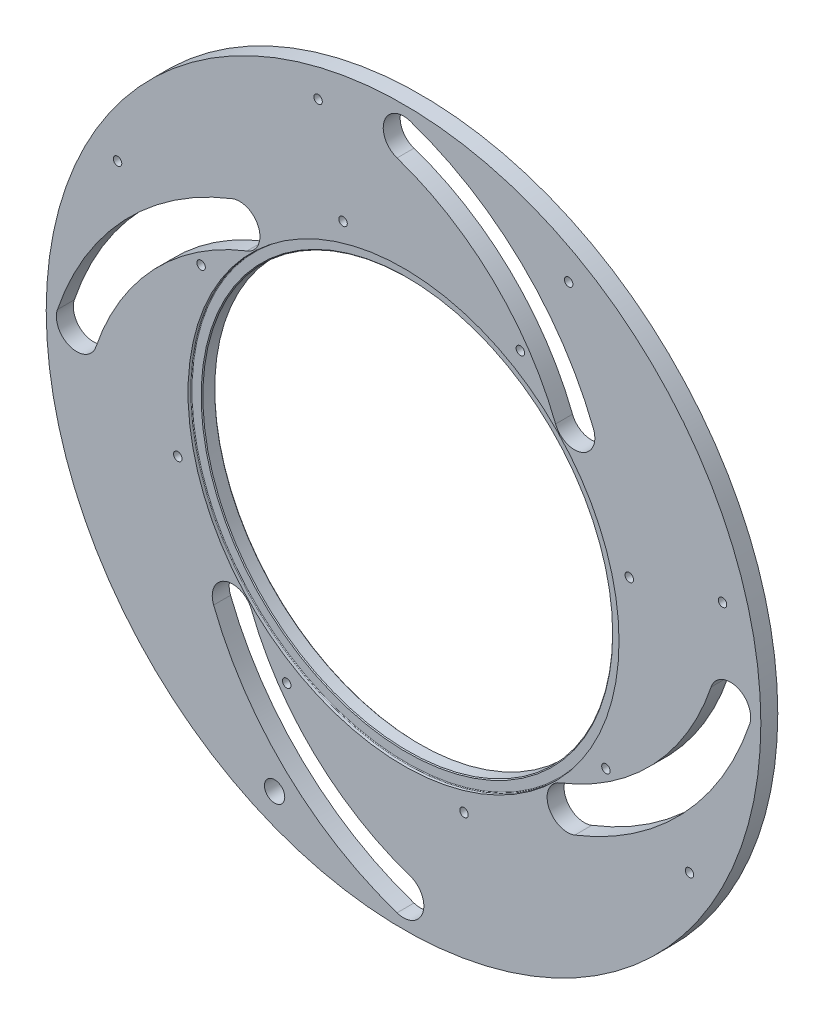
ISO-10303-21;
HEADER;
FILE_DESCRIPTION(('STEP AP214'),'2;1');
FILE_NAME('part.step','',(''),(''),'','','');
FILE_SCHEMA(('AUTOMOTIVE_DESIGN { 1 0 10303 214 1 1 1 1 }'));
ENDSEC;
DATA;
#1=APPLICATION_CONTEXT('core data for automotive mechanical design processes');
#2=APPLICATION_PROTOCOL_DEFINITION('international standard','automotive_design',2000,#1);
#3=PRODUCT_CONTEXT('',#1,'mechanical');
#4=PRODUCT('Part','Part','',(#3));
#5=PRODUCT_RELATED_PRODUCT_CATEGORY('part','',(#4));
#6=PRODUCT_DEFINITION_FORMATION('','',#4);
#7=PRODUCT_DEFINITION_CONTEXT('part definition',#1,'design');
#8=PRODUCT_DEFINITION('design','',#6,#7);
#9=PRODUCT_DEFINITION_SHAPE('','',#8);
#10=(LENGTH_UNIT() NAMED_UNIT(*) SI_UNIT(.MILLI.,.METRE.));
#11=(NAMED_UNIT(*) PLANE_ANGLE_UNIT() SI_UNIT($,.RADIAN.));
#12=(NAMED_UNIT(*) SI_UNIT($,.STERADIAN.) SOLID_ANGLE_UNIT());
#13=UNCERTAINTY_MEASURE_WITH_UNIT(LENGTH_MEASURE(1.E-05),#10,'distance_accuracy_value','');
#14=(GEOMETRIC_REPRESENTATION_CONTEXT(3) GLOBAL_UNCERTAINTY_ASSIGNED_CONTEXT((#13)) GLOBAL_UNIT_ASSIGNED_CONTEXT((#10,
#11,#12)) REPRESENTATION_CONTEXT('',''));
#15=CARTESIAN_POINT('',(0.,0.,0.));
#16=DIRECTION('',(0.,0.,1.));
#17=DIRECTION('',(1.,0.,0.));
#18=AXIS2_PLACEMENT_3D('',#15,#16,#17);
#19=CARTESIAN_POINT('',(0.,0.,10.));
#20=DIRECTION('',(0.,0.,1.));
#21=DIRECTION('',(1.,0.,0.));
#22=AXIS2_PLACEMENT_3D('',#19,#20,#21);
#23=PLANE('',#22);
#24=CARTESIAN_POINT('',(-168.874953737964,97.500000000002,10.));
#25=DIRECTION('',(0.,0.,-1.));
#26=DIRECTION('',(-1.,0.,0.));
#27=AXIS2_PLACEMENT_3D('',#24,#25,#26);
#28=CIRCLE('',#27,2.5);
#29=CARTESIAN_POINT('',(-171.374953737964,97.500000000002,10.));
#30=VERTEX_POINT('',#29);
#31=EDGE_CURVE('E519',#30,#30,#28,.T.);
#32=ORIENTED_EDGE('',*,*,#31,.T.);
#33=EDGE_LOOP('',(#32));
#34=FACE_BOUND('',#33,.T.);
#35=CARTESIAN_POINT('',(188.355536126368,50.4697137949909,10.));
#36=DIRECTION('',(0.,0.,-1.));
#37=DIRECTION('',(-1.,0.,0.));
#38=AXIS2_PLACEMENT_3D('',#35,#36,#37);
#39=CIRCLE('',#38,2.5);
#40=CARTESIAN_POINT('',(185.855536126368,50.4697137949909,10.));
#41=VERTEX_POINT('',#40);
#42=EDGE_CURVE('E503',#41,#41,#39,.T.);
#43=ORIENTED_EDGE('',*,*,#42,.T.);
#44=EDGE_LOOP('',(#43));
#45=FACE_BOUND('',#44,.T.);
#46=CARTESIAN_POINT('',(97.5000000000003,168.874953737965,10.));
#47=DIRECTION('',(0.,0.,-1.));
#48=DIRECTION('',(-1.,0.,0.));
#49=AXIS2_PLACEMENT_3D('',#46,#47,#48);
#50=CIRCLE('',#49,2.5);
#51=CARTESIAN_POINT('',(95.0000000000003,168.874953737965,10.));
#52=VERTEX_POINT('',#51);
#53=EDGE_CURVE('E495',#52,#52,#50,.T.);
#54=ORIENTED_EDGE('',*,*,#53,.T.);
#55=EDGE_LOOP('',(#54));
#56=FACE_BOUND('',#55,.T.);
#57=CARTESIAN_POINT('',(-119.511505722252,69.0000000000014,10.));
#58=DIRECTION('',(0.,0.,-1.));
#59=DIRECTION('',(-1.,0.,0.));
#60=AXIS2_PLACEMENT_3D('',#57,#58,#59);
#61=CIRCLE('',#60,2.5);
#62=CARTESIAN_POINT('',(-122.011505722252,69.0000000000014,10.));
#63=VERTEX_POINT('',#62);
#64=EDGE_CURVE('E479',#63,#63,#61,.T.);
#65=ORIENTED_EDGE('',*,*,#64,.T.);
#66=EDGE_LOOP('',(#65));
#67=FACE_BOUND('',#66,.T.);
#68=CARTESIAN_POINT('',(-69.000000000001,-119.511505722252,10.));
#69=DIRECTION('',(0.,0.,-1.));
#70=DIRECTION('',(-1.,0.,0.));
#71=AXIS2_PLACEMENT_3D('',#68,#69,#70);
#72=CIRCLE('',#71,2.5);
#73=CARTESIAN_POINT('',(-71.500000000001,-119.511505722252,10.));
#74=VERTEX_POINT('',#73);
#75=EDGE_CURVE('E463',#74,#74,#72,.T.);
#76=ORIENTED_EDGE('',*,*,#75,.T.);
#77=EDGE_LOOP('',(#76));
#78=FACE_BOUND('',#77,.T.);
#79=CARTESIAN_POINT('',(119.511505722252,-69.0000000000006,10.));
#80=DIRECTION('',(0.,0.,-1.));
#81=DIRECTION('',(-1.,0.,0.));
#82=AXIS2_PLACEMENT_3D('',#79,#80,#81);
#83=CIRCLE('',#82,2.5);
#84=CARTESIAN_POINT('',(117.011505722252,-69.0000000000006,10.));
#85=VERTEX_POINT('',#84);
#86=EDGE_CURVE('E447',#85,#85,#83,.T.);
#87=ORIENTED_EDGE('',*,*,#86,.T.);
#88=EDGE_LOOP('',(#87));
#89=FACE_BOUND('',#88,.T.);
#90=CARTESIAN_POINT('',(133.297764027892,35.7170282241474,10.));
#91=DIRECTION('',(0.,0.,-1.));
#92=DIRECTION('',(-1.,0.,0.));
#93=AXIS2_PLACEMENT_3D('',#90,#91,#92);
#94=CIRCLE('',#93,2.5);
#95=CARTESIAN_POINT('',(130.797764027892,35.7170282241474,10.));
#96=VERTEX_POINT('',#95);
#97=EDGE_CURVE('E439',#96,#96,#94,.T.);
#98=ORIENTED_EDGE('',*,*,#97,.T.);
#99=EDGE_LOOP('',(#98));
#100=FACE_BOUND('',#99,.T.);
#101=CARTESIAN_POINT('',(69.0000000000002,119.511505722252,10.));
#102=DIRECTION('',(0.,0.,-1.));
#103=DIRECTION('',(-1.,0.,0.));
#104=AXIS2_PLACEMENT_3D('',#101,#102,#103);
#105=CIRCLE('',#104,2.5);
#106=CARTESIAN_POINT('',(66.5000000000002,119.511505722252,10.));
#107=VERTEX_POINT('',#106);
#108=EDGE_CURVE('E431',#107,#107,#105,.T.);
#109=ORIENTED_EDGE('',*,*,#108,.T.);
#110=EDGE_LOOP('',(#109));
#111=FACE_BOUND('',#110,.T.);
#112=CARTESIAN_POINT('',(0.,0.,10.));
#113=DIRECTION('',(0.,0.,1.));
#114=DIRECTION('',(1.,0.,0.));
#115=AXIS2_PLACEMENT_3D('',#112,#113,#114);
#116=CIRCLE('',#115,127.25);
#117=CARTESIAN_POINT('',(127.25,0.,10.));
#118=VERTEX_POINT('',#117);
#119=EDGE_CURVE('E426',#118,#118,#116,.T.);
#120=ORIENTED_EDGE('',*,*,#119,.F.);
#121=EDGE_LOOP('',(#120));
#122=FACE_BOUND('',#121,.T.);
#123=CARTESIAN_POINT('',(-76.1279568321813,-178.439161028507,10.));
#124=DIRECTION('',(0.,0.,1.));
#125=DIRECTION('',(1.,0.,0.));
#126=AXIS2_PLACEMENT_3D('',#123,#124,#125);
#127=CIRCLE('',#126,6.);
#128=CARTESIAN_POINT('',(-70.1279568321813,-178.439161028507,10.));
#129=VERTEX_POINT('',#128);
#130=EDGE_CURVE('E187',#129,#129,#127,.T.);
#131=ORIENTED_EDGE('',*,*,#130,.F.);
#132=EDGE_LOOP('',(#131));
#133=FACE_BOUND('',#132,.T.);
#134=CARTESIAN_POINT('',(-36.6356255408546,-52.6799999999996,10.));
#135=DIRECTION('',(0.,0.,-1.));
#136=DIRECTION('',(0.,1.,0.));
#137=AXIS2_PLACEMENT_3D('',#134,#135,#136);
#138=CIRCLE('',#137,153.);
#139=CARTESIAN_POINT('',(-181.62804549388,-3.83127272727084,10.));
#140=VERTEX_POINT('',#139);
#141=CARTESIAN_POINT('',(-92.4146605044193,89.7899942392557,10.));
#142=VERTEX_POINT('',#141);
#143=EDGE_CURVE('E61',#140,#142,#138,.T.);
#144=ORIENTED_EDGE('',*,*,#143,.F.);
#145=CARTESIAN_POINT('',(-193.,2.02156769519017E-12,10.));
#146=DIRECTION('',(0.,0.,1.));
#147=DIRECTION('',(0.,1.,0.));
#148=AXIS2_PLACEMENT_3D('',#145,#146,#147);
#149=CIRCLE('',#148,12.);
#150=CARTESIAN_POINT('',(-204.37195450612,3.83127272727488,10.));
#151=VERTEX_POINT('',#150);
#152=EDGE_CURVE('E180',#151,#140,#149,.T.);
#153=ORIENTED_EDGE('',*,*,#152,.F.);
#154=CARTESIAN_POINT('',(-36.6356255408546,-52.6799999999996,10.));
#155=DIRECTION('',(0.,0.,1.));
#156=DIRECTION('',(0.,1.,0.));
#157=AXIS2_PLACEMENT_3D('',#154,#155,#156);
#158=CIRCLE('',#157,177.);
#159=CARTESIAN_POINT('',(-101.164313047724,112.138228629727,10.));
#160=VERTEX_POINT('',#159);
#161=EDGE_CURVE('E184',#160,#151,#158,.T.);
#162=ORIENTED_EDGE('',*,*,#161,.F.);
#163=CARTESIAN_POINT('',(-96.7894867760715,100.964111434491,10.));
#164=DIRECTION('',(0.,0.,1.));
#165=DIRECTION('',(0.,1.,0.));
#166=AXIS2_PLACEMENT_3D('',#163,#164,#165);
#167=CIRCLE('',#166,12.);
#168=EDGE_CURVE('E196',#142,#160,#167,.T.);
#169=ORIENTED_EDGE('',*,*,#168,.F.);
#170=EDGE_LOOP('',(#144,#153,#162,#169));
#171=FACE_BOUND('',#170,.T.);
#172=CARTESIAN_POINT('',(52.6799999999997,-36.6356255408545,10.));
#173=DIRECTION('',(0.,0.,-1.));
#174=DIRECTION('',(-1.,0.,0.));
#175=AXIS2_PLACEMENT_3D('',#172,#173,#174);
#176=CIRCLE('',#175,153.);
#177=CARTESIAN_POINT('',(3.83127272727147,-181.62804549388,10.));
#178=VERTEX_POINT('',#177);
#179=CARTESIAN_POINT('',(-89.7899942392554,-92.4146605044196,10.));
#180=VERTEX_POINT('',#179);
#181=EDGE_CURVE('E206',#178,#180,#176,.T.);
#182=ORIENTED_EDGE('',*,*,#181,.F.);
#183=CARTESIAN_POINT('',(-1.34771179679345E-12,-193.,10.));
#184=DIRECTION('',(0.,0.,1.));
#185=DIRECTION('',(-1.,0.,0.));
#186=AXIS2_PLACEMENT_3D('',#183,#184,#185);
#187=CIRCLE('',#186,12.);
#188=CARTESIAN_POINT('',(-3.83127272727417,-204.37195450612,10.));
#189=VERTEX_POINT('',#188);
#190=EDGE_CURVE('E217',#189,#178,#187,.T.);
#191=ORIENTED_EDGE('',*,*,#190,.F.);
#192=CARTESIAN_POINT('',(52.6799999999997,-36.6356255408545,10.));
#193=DIRECTION('',(0.,0.,1.));
#194=DIRECTION('',(-1.,0.,0.));
#195=AXIS2_PLACEMENT_3D('',#192,#193,#194);
#196=CIRCLE('',#195,177.);
#197=CARTESIAN_POINT('',(-112.138228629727,-101.164313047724,10.));
#198=VERTEX_POINT('',#197);
#199=EDGE_CURVE('E236',#198,#189,#196,.T.);
#200=ORIENTED_EDGE('',*,*,#199,.F.);
#201=CARTESIAN_POINT('',(-100.964111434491,-96.7894867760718,10.));
#202=DIRECTION('',(0.,0.,1.));
#203=DIRECTION('',(-1.,0.,0.));
#204=AXIS2_PLACEMENT_3D('',#201,#202,#203);
#205=CIRCLE('',#204,12.);
#206=EDGE_CURVE('E232',#180,#198,#205,.T.);
#207=ORIENTED_EDGE('',*,*,#206,.F.);
#208=EDGE_LOOP('',(#182,#191,#200,#207));
#209=FACE_BOUND('',#208,.T.);
#210=CARTESIAN_POINT('',(36.6356255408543,52.6799999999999,10.));
#211=DIRECTION('',(0.,0.,-1.));
#212=DIRECTION('',(0.,-1.,0.));
#213=AXIS2_PLACEMENT_3D('',#210,#211,#212);
#214=CIRCLE('',#213,153.);
#215=CARTESIAN_POINT('',(181.62804549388,3.83127272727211,10.));
#216=VERTEX_POINT('',#215);
#217=CARTESIAN_POINT('',(92.4146605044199,-89.789994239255,10.));
#218=VERTEX_POINT('',#217);
#219=EDGE_CURVE('E246',#216,#218,#214,.T.);
#220=ORIENTED_EDGE('',*,*,#219,.F.);
#221=CARTESIAN_POINT('',(193.,-6.73855898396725E-13,10.));
#222=DIRECTION('',(0.,0.,1.));
#223=DIRECTION('',(0.,-1.,0.));
#224=AXIS2_PLACEMENT_3D('',#221,#222,#223);
#225=CIRCLE('',#224,12.);
#226=CARTESIAN_POINT('',(204.37195450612,-3.83127272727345,10.));
#227=VERTEX_POINT('',#226);
#228=EDGE_CURVE('E261',#227,#216,#225,.T.);
#229=ORIENTED_EDGE('',*,*,#228,.F.);
#230=CARTESIAN_POINT('',(36.6356255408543,52.6799999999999,10.));
#231=DIRECTION('',(0.,0.,1.));
#232=DIRECTION('',(0.,-1.,0.));
#233=AXIS2_PLACEMENT_3D('',#230,#231,#232);
#234=CIRCLE('',#233,177.);
#235=CARTESIAN_POINT('',(101.164313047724,-112.138228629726,10.));
#236=VERTEX_POINT('',#235);
#237=EDGE_CURVE('E280',#236,#227,#234,.T.);
#238=ORIENTED_EDGE('',*,*,#237,.F.);
#239=CARTESIAN_POINT('',(96.7894867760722,-100.964111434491,10.));
#240=DIRECTION('',(0.,0.,1.));
#241=DIRECTION('',(0.,-1.,0.));
#242=AXIS2_PLACEMENT_3D('',#239,#240,#241);
#243=CIRCLE('',#242,12.);
#244=EDGE_CURVE('E276',#218,#236,#243,.T.);
#245=ORIENTED_EDGE('',*,*,#244,.F.);
#246=EDGE_LOOP('',(#220,#229,#238,#245));
#247=FACE_BOUND('',#246,.T.);
#248=CARTESIAN_POINT('',(-52.68,36.6356255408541,10.));
#249=DIRECTION('',(0.,0.,-1.));
#250=DIRECTION('',(1.,0.,0.));
#251=AXIS2_PLACEMENT_3D('',#248,#249,#250);
#252=CIRCLE('',#251,153.);
#253=CARTESIAN_POINT('',(-3.83127272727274,181.62804549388,10.));
#254=VERTEX_POINT('',#253);
#255=CARTESIAN_POINT('',(89.7899942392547,92.4146605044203,10.));
#256=VERTEX_POINT('',#255);
#257=EDGE_CURVE('E290',#254,#256,#252,.T.);
#258=ORIENTED_EDGE('',*,*,#257,.F.);
#259=CARTESIAN_POINT('',(0.,193.,10.));
#260=DIRECTION('',(0.,0.,1.));
#261=DIRECTION('',(1.,0.,0.));
#262=AXIS2_PLACEMENT_3D('',#259,#260,#261);
#263=CIRCLE('',#262,12.);
#264=CARTESIAN_POINT('',(3.83127272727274,204.37195450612,10.));
#265=VERTEX_POINT('',#264);
#266=EDGE_CURVE('E305',#265,#254,#263,.T.);
#267=ORIENTED_EDGE('',*,*,#266,.F.);
#268=CARTESIAN_POINT('',(-52.68,36.6356255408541,10.));
#269=DIRECTION('',(0.,0.,1.));
#270=DIRECTION('',(1.,0.,0.));
#271=AXIS2_PLACEMENT_3D('',#268,#269,#270);
#272=CIRCLE('',#271,177.);
#273=CARTESIAN_POINT('',(112.138228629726,101.164313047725,10.));
#274=VERTEX_POINT('',#273);
#275=EDGE_CURVE('E324',#274,#265,#272,.T.);
#276=ORIENTED_EDGE('',*,*,#275,.F.);
#277=CARTESIAN_POINT('',(100.96411143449,96.7894867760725,10.));
#278=DIRECTION('',(0.,0.,1.));
#279=DIRECTION('',(1.,0.,0.));
#280=AXIS2_PLACEMENT_3D('',#277,#278,#279);
#281=CIRCLE('',#280,12.);
#282=EDGE_CURVE('E320',#256,#274,#281,.T.);
#283=ORIENTED_EDGE('',*,*,#282,.F.);
#284=EDGE_LOOP('',(#258,#267,#276,#283));
#285=FACE_BOUND('',#284,.T.);
#286=CARTESIAN_POINT('',(0.,0.,10.));
#287=DIRECTION('',(0.,0.,1.));
#288=DIRECTION('',(1.,0.,0.));
#289=AXIS2_PLACEMENT_3D('',#286,#287,#288);
#290=CIRCLE('',#289,211.);
#291=CARTESIAN_POINT('',(211.,0.,10.));
#292=VERTEX_POINT('',#291);
#293=EDGE_CURVE('E344',#292,#292,#290,.T.);
#294=ORIENTED_EDGE('',*,*,#293,.T.);
#295=EDGE_LOOP('',(#294));
#296=FACE_BOUND('',#295,.T.);
#297=CARTESIAN_POINT('',(35.717028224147,-133.297764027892,10.));
#298=DIRECTION('',(0.,0.,-1.));
#299=DIRECTION('',(-1.,0.,0.));
#300=AXIS2_PLACEMENT_3D('',#297,#298,#299);
#301=CIRCLE('',#300,2.5);
#302=CARTESIAN_POINT('',(33.217028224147,-133.297764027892,10.));
#303=VERTEX_POINT('',#302);
#304=EDGE_CURVE('E455',#303,#303,#301,.T.);
#305=ORIENTED_EDGE('',*,*,#304,.T.);
#306=EDGE_LOOP('',(#305));
#307=FACE_BOUND('',#306,.T.);
#308=CARTESIAN_POINT('',(-133.297764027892,-35.7170282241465,10.));
#309=DIRECTION('',(0.,0.,-1.));
#310=DIRECTION('',(-1.,0.,0.));
#311=AXIS2_PLACEMENT_3D('',#308,#309,#310);
#312=CIRCLE('',#311,2.5);
#313=CARTESIAN_POINT('',(-135.797764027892,-35.7170282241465,10.));
#314=VERTEX_POINT('',#313);
#315=EDGE_CURVE('E471',#314,#314,#312,.T.);
#316=ORIENTED_EDGE('',*,*,#315,.T.);
#317=EDGE_LOOP('',(#316));
#318=FACE_BOUND('',#317,.T.);
#319=CARTESIAN_POINT('',(-35.7170282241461,133.297764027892,10.));
#320=DIRECTION('',(0.,0.,-1.));
#321=DIRECTION('',(-1.,0.,0.));
#322=AXIS2_PLACEMENT_3D('',#319,#320,#321);
#323=CIRCLE('',#322,2.5);
#324=CARTESIAN_POINT('',(-38.217028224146,133.297764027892,10.));
#325=VERTEX_POINT('',#324);
#326=EDGE_CURVE('E487',#325,#325,#323,.T.);
#327=ORIENTED_EDGE('',*,*,#326,.T.);
#328=EDGE_LOOP('',(#327));
#329=FACE_BOUND('',#328,.T.);
#330=CARTESIAN_POINT('',(168.874953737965,-97.5000000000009,10.));
#331=DIRECTION('',(0.,0.,-1.));
#332=DIRECTION('',(-1.,0.,0.));
#333=AXIS2_PLACEMENT_3D('',#330,#331,#332);
#334=CIRCLE('',#333,2.5);
#335=CARTESIAN_POINT('',(166.374953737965,-97.5000000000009,10.));
#336=VERTEX_POINT('',#335);
#337=EDGE_CURVE('E511',#336,#336,#334,.T.);
#338=ORIENTED_EDGE('',*,*,#337,.T.);
#339=EDGE_LOOP('',(#338));
#340=FACE_BOUND('',#339,.T.);
#341=CARTESIAN_POINT('',(-50.4697137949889,188.355536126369,10.));
#342=DIRECTION('',(0.,0.,-1.));
#343=DIRECTION('',(-1.,0.,0.));
#344=AXIS2_PLACEMENT_3D('',#341,#342,#343);
#345=CIRCLE('',#344,2.5);
#346=CARTESIAN_POINT('',(-52.9697137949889,188.355536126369,10.));
#347=VERTEX_POINT('',#346);
#348=EDGE_CURVE('E526',#347,#347,#345,.T.);
#349=ORIENTED_EDGE('',*,*,#348,.T.);
#350=EDGE_LOOP('',(#349));
#351=FACE_BOUND('',#350,.T.);
#352=ADVANCED_FACE('F45',(#34,#45,#56,#67,#78,#89,#100,#111,#122,#133,#171,#209,#247,#285,#296,
#307,#318,#329,#340,#351),#23,.T.);
#353=CARTESIAN_POINT('',(0.,0.,0.));
#354=DIRECTION('',(0.,0.,1.));
#355=DIRECTION('',(1.,0.,0.));
#356=AXIS2_PLACEMENT_3D('',#353,#354,#355);
#357=PLANE('',#356);
#358=CARTESIAN_POINT('',(-50.4697137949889,188.355536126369,0.));
#359=DIRECTION('',(0.,0.,-1.));
#360=DIRECTION('',(-1.,0.,0.));
#361=AXIS2_PLACEMENT_3D('',#358,#359,#360);
#362=CIRCLE('',#361,2.49999999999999);
#363=CARTESIAN_POINT('',(-52.9697137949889,188.355536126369,0.));
#364=VERTEX_POINT('',#363);
#365=EDGE_CURVE('E530',#364,#364,#362,.T.);
#366=ORIENTED_EDGE('',*,*,#365,.F.);
#367=EDGE_LOOP('',(#366));
#368=FACE_BOUND('',#367,.T.);
#369=CARTESIAN_POINT('',(168.874953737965,-97.5000000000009,0.));
#370=DIRECTION('',(0.,0.,-1.));
#371=DIRECTION('',(-1.,0.,0.));
#372=AXIS2_PLACEMENT_3D('',#369,#370,#371);
#373=CIRCLE('',#372,2.49999999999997);
#374=CARTESIAN_POINT('',(166.374953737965,-97.5000000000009,0.));
#375=VERTEX_POINT('',#374);
#376=EDGE_CURVE('E515',#375,#375,#373,.T.);
#377=ORIENTED_EDGE('',*,*,#376,.F.);
#378=EDGE_LOOP('',(#377));
#379=FACE_BOUND('',#378,.T.);
#380=CARTESIAN_POINT('',(97.5000000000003,168.874953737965,0.));
#381=DIRECTION('',(0.,0.,-1.));
#382=DIRECTION('',(-1.,0.,0.));
#383=AXIS2_PLACEMENT_3D('',#380,#381,#382);
#384=CIRCLE('',#383,2.49999999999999);
#385=CARTESIAN_POINT('',(95.0000000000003,168.874953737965,0.));
#386=VERTEX_POINT('',#385);
#387=EDGE_CURVE('E499',#386,#386,#384,.T.);
#388=ORIENTED_EDGE('',*,*,#387,.F.);
#389=EDGE_LOOP('',(#388));
#390=FACE_BOUND('',#389,.T.);
#391=CARTESIAN_POINT('',(-69.000000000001,-119.511505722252,0.));
#392=DIRECTION('',(0.,0.,-1.));
#393=DIRECTION('',(-1.,0.,0.));
#394=AXIS2_PLACEMENT_3D('',#391,#392,#393);
#395=CIRCLE('',#394,2.5);
#396=CARTESIAN_POINT('',(-71.500000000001,-119.511505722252,0.));
#397=VERTEX_POINT('',#396);
#398=EDGE_CURVE('E467',#397,#397,#395,.T.);
#399=ORIENTED_EDGE('',*,*,#398,.F.);
#400=EDGE_LOOP('',(#399));
#401=FACE_BOUND('',#400,.T.);
#402=CARTESIAN_POINT('',(119.511505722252,-69.0000000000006,0.));
#403=DIRECTION('',(0.,0.,-1.));
#404=DIRECTION('',(-1.,0.,0.));
#405=AXIS2_PLACEMENT_3D('',#402,#403,#404);
#406=CIRCLE('',#405,2.5);
#407=CARTESIAN_POINT('',(117.011505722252,-69.0000000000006,0.));
#408=VERTEX_POINT('',#407);
#409=EDGE_CURVE('E451',#408,#408,#406,.T.);
#410=ORIENTED_EDGE('',*,*,#409,.F.);
#411=EDGE_LOOP('',(#410));
#412=FACE_BOUND('',#411,.T.);
#413=CARTESIAN_POINT('',(133.297764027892,35.7170282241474,0.));
#414=DIRECTION('',(0.,0.,-1.));
#415=DIRECTION('',(-1.,0.,0.));
#416=AXIS2_PLACEMENT_3D('',#413,#414,#415);
#417=CIRCLE('',#416,2.5);
#418=CARTESIAN_POINT('',(130.797764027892,35.7170282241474,0.));
#419=VERTEX_POINT('',#418);
#420=EDGE_CURVE('E443',#419,#419,#417,.T.);
#421=ORIENTED_EDGE('',*,*,#420,.F.);
#422=EDGE_LOOP('',(#421));
#423=FACE_BOUND('',#422,.T.);
#424=CARTESIAN_POINT('',(69.0000000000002,119.511505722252,0.));
#425=DIRECTION('',(0.,0.,-1.));
#426=DIRECTION('',(-1.,0.,0.));
#427=AXIS2_PLACEMENT_3D('',#424,#425,#426);
#428=CIRCLE('',#427,2.5);
#429=CARTESIAN_POINT('',(66.5000000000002,119.511505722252,0.));
#430=VERTEX_POINT('',#429);
#431=EDGE_CURVE('E435',#430,#430,#428,.T.);
#432=ORIENTED_EDGE('',*,*,#431,.F.);
#433=EDGE_LOOP('',(#432));
#434=FACE_BOUND('',#433,.T.);
#435=CARTESIAN_POINT('',(0.,0.,0.));
#436=DIRECTION('',(0.,0.,1.));
#437=DIRECTION('',(1.,0.,0.));
#438=AXIS2_PLACEMENT_3D('',#435,#436,#437);
#439=CIRCLE('',#438,121.5);
#440=CARTESIAN_POINT('',(121.5,0.,0.));
#441=VERTEX_POINT('',#440);
#442=EDGE_CURVE('E363',#441,#441,#439,.T.);
#443=ORIENTED_EDGE('',*,*,#442,.T.);
#444=EDGE_LOOP('',(#443));
#445=FACE_BOUND('',#444,.T.);
#446=CARTESIAN_POINT('',(-76.1279568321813,-178.439161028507,0.));
#447=DIRECTION('',(0.,0.,1.));
#448=DIRECTION('',(1.,0.,0.));
#449=AXIS2_PLACEMENT_3D('',#446,#447,#448);
#450=CIRCLE('',#449,6.);
#451=CARTESIAN_POINT('',(-70.1279568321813,-178.439161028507,0.));
#452=VERTEX_POINT('',#451);
#453=EDGE_CURVE('E197',#452,#452,#450,.T.);
#454=ORIENTED_EDGE('',*,*,#453,.T.);
#455=EDGE_LOOP('',(#454));
#456=FACE_BOUND('',#455,.T.);
#457=CARTESIAN_POINT('',(-193.,2.02156769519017E-12,0.));
#458=DIRECTION('',(0.,0.,1.));
#459=DIRECTION('',(0.,1.,0.));
#460=AXIS2_PLACEMENT_3D('',#457,#458,#459);
#461=CIRCLE('',#460,12.);
#462=CARTESIAN_POINT('',(-204.37195450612,3.83127272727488,0.));
#463=VERTEX_POINT('',#462);
#464=CARTESIAN_POINT('',(-181.62804549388,-3.83127272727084,0.));
#465=VERTEX_POINT('',#464);
#466=EDGE_CURVE('E168',#463,#465,#461,.T.);
#467=ORIENTED_EDGE('',*,*,#466,.T.);
#468=CARTESIAN_POINT('',(-36.6356255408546,-52.6799999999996,0.));
#469=DIRECTION('',(0.,0.,-1.));
#470=DIRECTION('',(0.,1.,0.));
#471=AXIS2_PLACEMENT_3D('',#468,#469,#470);
#472=CIRCLE('',#471,153.);
#473=CARTESIAN_POINT('',(-92.4146605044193,89.7899942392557,0.));
#474=VERTEX_POINT('',#473);
#475=EDGE_CURVE('E161',#465,#474,#472,.T.);
#476=ORIENTED_EDGE('',*,*,#475,.T.);
#477=CARTESIAN_POINT('',(-96.7894867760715,100.964111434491,0.));
#478=DIRECTION('',(0.,0.,1.));
#479=DIRECTION('',(0.,1.,0.));
#480=AXIS2_PLACEMENT_3D('',#477,#478,#479);
#481=CIRCLE('',#480,12.);
#482=CARTESIAN_POINT('',(-101.164313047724,112.138228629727,0.));
#483=VERTEX_POINT('',#482);
#484=EDGE_CURVE('E171',#474,#483,#481,.T.);
#485=ORIENTED_EDGE('',*,*,#484,.T.);
#486=CARTESIAN_POINT('',(-36.6356255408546,-52.6799999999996,0.));
#487=DIRECTION('',(0.,0.,1.));
#488=DIRECTION('',(0.,1.,0.));
#489=AXIS2_PLACEMENT_3D('',#486,#487,#488);
#490=CIRCLE('',#489,177.);
#491=EDGE_CURVE('E69',#483,#463,#490,.T.);
#492=ORIENTED_EDGE('',*,*,#491,.T.);
#493=EDGE_LOOP('',(#467,#476,#485,#492));
#494=FACE_BOUND('',#493,.T.);
#495=CARTESIAN_POINT('',(-1.34771179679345E-12,-193.,0.));
#496=DIRECTION('',(0.,0.,1.));
#497=DIRECTION('',(-1.,0.,0.));
#498=AXIS2_PLACEMENT_3D('',#495,#496,#497);
#499=CIRCLE('',#498,12.);
#500=CARTESIAN_POINT('',(-3.83127272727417,-204.37195450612,0.));
#501=VERTEX_POINT('',#500);
#502=CARTESIAN_POINT('',(3.83127272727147,-181.62804549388,0.));
#503=VERTEX_POINT('',#502);
#504=EDGE_CURVE('E225',#501,#503,#499,.T.);
#505=ORIENTED_EDGE('',*,*,#504,.T.);
#506=CARTESIAN_POINT('',(52.6799999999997,-36.6356255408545,0.));
#507=DIRECTION('',(0.,0.,-1.));
#508=DIRECTION('',(-1.,0.,0.));
#509=AXIS2_PLACEMENT_3D('',#506,#507,#508);
#510=CIRCLE('',#509,153.);
#511=CARTESIAN_POINT('',(-89.7899942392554,-92.4146605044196,0.));
#512=VERTEX_POINT('',#511);
#513=EDGE_CURVE('E212',#503,#512,#510,.T.);
#514=ORIENTED_EDGE('',*,*,#513,.T.);
#515=CARTESIAN_POINT('',(-100.964111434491,-96.7894867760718,0.));
#516=DIRECTION('',(0.,0.,1.));
#517=DIRECTION('',(-1.,0.,0.));
#518=AXIS2_PLACEMENT_3D('',#515,#516,#517);
#519=CIRCLE('',#518,12.);
#520=CARTESIAN_POINT('',(-112.138228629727,-101.164313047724,0.));
#521=VERTEX_POINT('',#520);
#522=EDGE_CURVE('E216',#512,#521,#519,.T.);
#523=ORIENTED_EDGE('',*,*,#522,.T.);
#524=CARTESIAN_POINT('',(52.6799999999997,-36.6356255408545,0.));
#525=DIRECTION('',(0.,0.,1.));
#526=DIRECTION('',(-1.,0.,0.));
#527=AXIS2_PLACEMENT_3D('',#524,#525,#526);
#528=CIRCLE('',#527,177.);
#529=EDGE_CURVE('E221',#521,#501,#528,.T.);
#530=ORIENTED_EDGE('',*,*,#529,.T.);
#531=EDGE_LOOP('',(#505,#514,#523,#530));
#532=FACE_BOUND('',#531,.T.);
#533=CARTESIAN_POINT('',(193.,-6.73855898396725E-13,0.));
#534=DIRECTION('',(0.,0.,1.));
#535=DIRECTION('',(0.,-1.,0.));
#536=AXIS2_PLACEMENT_3D('',#533,#534,#535);
#537=CIRCLE('',#536,12.);
#538=CARTESIAN_POINT('',(204.37195450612,-3.83127272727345,0.));
#539=VERTEX_POINT('',#538);
#540=CARTESIAN_POINT('',(181.62804549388,3.83127272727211,0.));
#541=VERTEX_POINT('',#540);
#542=EDGE_CURVE('E269',#539,#541,#537,.T.);
#543=ORIENTED_EDGE('',*,*,#542,.T.);
#544=CARTESIAN_POINT('',(36.6356255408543,52.6799999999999,0.));
#545=DIRECTION('',(0.,0.,-1.));
#546=DIRECTION('',(0.,-1.,0.));
#547=AXIS2_PLACEMENT_3D('',#544,#545,#546);
#548=CIRCLE('',#547,153.);
#549=CARTESIAN_POINT('',(92.4146605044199,-89.789994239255,0.));
#550=VERTEX_POINT('',#549);
#551=EDGE_CURVE('E256',#541,#550,#548,.T.);
#552=ORIENTED_EDGE('',*,*,#551,.T.);
#553=CARTESIAN_POINT('',(96.7894867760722,-100.964111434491,0.));
#554=DIRECTION('',(0.,0.,1.));
#555=DIRECTION('',(0.,-1.,0.));
#556=AXIS2_PLACEMENT_3D('',#553,#554,#555);
#557=CIRCLE('',#556,12.);
#558=CARTESIAN_POINT('',(101.164313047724,-112.138228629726,0.));
#559=VERTEX_POINT('',#558);
#560=EDGE_CURVE('E260',#550,#559,#557,.T.);
#561=ORIENTED_EDGE('',*,*,#560,.T.);
#562=CARTESIAN_POINT('',(36.6356255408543,52.6799999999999,0.));
#563=DIRECTION('',(0.,0.,1.));
#564=DIRECTION('',(0.,-1.,0.));
#565=AXIS2_PLACEMENT_3D('',#562,#563,#564);
#566=CIRCLE('',#565,177.);
#567=EDGE_CURVE('E265',#559,#539,#566,.T.);
#568=ORIENTED_EDGE('',*,*,#567,.T.);
#569=EDGE_LOOP('',(#543,#552,#561,#568));
#570=FACE_BOUND('',#569,.T.);
#571=CARTESIAN_POINT('',(0.,193.,0.));
#572=DIRECTION('',(0.,0.,1.));
#573=DIRECTION('',(1.,0.,0.));
#574=AXIS2_PLACEMENT_3D('',#571,#572,#573);
#575=CIRCLE('',#574,12.);
#576=CARTESIAN_POINT('',(3.83127272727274,204.37195450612,0.));
#577=VERTEX_POINT('',#576);
#578=CARTESIAN_POINT('',(-3.83127272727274,181.62804549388,0.));
#579=VERTEX_POINT('',#578);
#580=EDGE_CURVE('E313',#577,#579,#575,.T.);
#581=ORIENTED_EDGE('',*,*,#580,.T.);
#582=CARTESIAN_POINT('',(-52.68,36.6356255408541,0.));
#583=DIRECTION('',(0.,0.,-1.));
#584=DIRECTION('',(1.,0.,0.));
#585=AXIS2_PLACEMENT_3D('',#582,#583,#584);
#586=CIRCLE('',#585,153.);
#587=CARTESIAN_POINT('',(89.7899942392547,92.4146605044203,0.));
#588=VERTEX_POINT('',#587);
#589=EDGE_CURVE('E300',#579,#588,#586,.T.);
#590=ORIENTED_EDGE('',*,*,#589,.T.);
#591=CARTESIAN_POINT('',(100.96411143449,96.7894867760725,0.));
#592=DIRECTION('',(0.,0.,1.));
#593=DIRECTION('',(1.,0.,0.));
#594=AXIS2_PLACEMENT_3D('',#591,#592,#593);
#595=CIRCLE('',#594,12.);
#596=CARTESIAN_POINT('',(112.138228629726,101.164313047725,0.));
#597=VERTEX_POINT('',#596);
#598=EDGE_CURVE('E304',#588,#597,#595,.T.);
#599=ORIENTED_EDGE('',*,*,#598,.T.);
#600=CARTESIAN_POINT('',(-52.68,36.6356255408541,0.));
#601=DIRECTION('',(0.,0.,1.));
#602=DIRECTION('',(1.,0.,0.));
#603=AXIS2_PLACEMENT_3D('',#600,#601,#602);
#604=CIRCLE('',#603,177.);
#605=EDGE_CURVE('E309',#597,#577,#604,.T.);
#606=ORIENTED_EDGE('',*,*,#605,.T.);
#607=EDGE_LOOP('',(#581,#590,#599,#606));
#608=FACE_BOUND('',#607,.T.);
#609=CARTESIAN_POINT('',(0.,0.,0.));
#610=DIRECTION('',(0.,0.,1.));
#611=DIRECTION('',(1.,0.,0.));
#612=AXIS2_PLACEMENT_3D('',#609,#610,#611);
#613=CIRCLE('',#612,211.);
#614=CARTESIAN_POINT('',(211.,0.,0.));
#615=VERTEX_POINT('',#614);
#616=EDGE_CURVE('E334',#615,#615,#613,.T.);
#617=ORIENTED_EDGE('',*,*,#616,.F.);
#618=EDGE_LOOP('',(#617));
#619=FACE_BOUND('',#618,.T.);
#620=CARTESIAN_POINT('',(35.717028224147,-133.297764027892,0.));
#621=DIRECTION('',(0.,0.,-1.));
#622=DIRECTION('',(-1.,0.,0.));
#623=AXIS2_PLACEMENT_3D('',#620,#621,#622);
#624=CIRCLE('',#623,2.5);
#625=CARTESIAN_POINT('',(33.217028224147,-133.297764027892,0.));
#626=VERTEX_POINT('',#625);
#627=EDGE_CURVE('E459',#626,#626,#624,.T.);
#628=ORIENTED_EDGE('',*,*,#627,.F.);
#629=EDGE_LOOP('',(#628));
#630=FACE_BOUND('',#629,.T.);
#631=CARTESIAN_POINT('',(-133.297764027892,-35.7170282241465,0.));
#632=DIRECTION('',(0.,0.,-1.));
#633=DIRECTION('',(-1.,0.,0.));
#634=AXIS2_PLACEMENT_3D('',#631,#632,#633);
#635=CIRCLE('',#634,2.5);
#636=CARTESIAN_POINT('',(-135.797764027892,-35.7170282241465,0.));
#637=VERTEX_POINT('',#636);
#638=EDGE_CURVE('E475',#637,#637,#635,.T.);
#639=ORIENTED_EDGE('',*,*,#638,.F.);
#640=EDGE_LOOP('',(#639));
#641=FACE_BOUND('',#640,.T.);
#642=CARTESIAN_POINT('',(-119.511505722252,69.0000000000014,0.));
#643=DIRECTION('',(0.,0.,-1.));
#644=DIRECTION('',(-1.,0.,0.));
#645=AXIS2_PLACEMENT_3D('',#642,#643,#644);
#646=CIRCLE('',#645,2.5);
#647=CARTESIAN_POINT('',(-122.011505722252,69.0000000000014,0.));
#648=VERTEX_POINT('',#647);
#649=EDGE_CURVE('E483',#648,#648,#646,.T.);
#650=ORIENTED_EDGE('',*,*,#649,.F.);
#651=EDGE_LOOP('',(#650));
#652=FACE_BOUND('',#651,.T.);
#653=CARTESIAN_POINT('',(-35.7170282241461,133.297764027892,0.));
#654=DIRECTION('',(0.,0.,-1.));
#655=DIRECTION('',(-1.,0.,0.));
#656=AXIS2_PLACEMENT_3D('',#653,#654,#655);
#657=CIRCLE('',#656,2.5);
#658=CARTESIAN_POINT('',(-38.2170282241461,133.297764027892,0.));
#659=VERTEX_POINT('',#658);
#660=EDGE_CURVE('E491',#659,#659,#657,.T.);
#661=ORIENTED_EDGE('',*,*,#660,.F.);
#662=EDGE_LOOP('',(#661));
#663=FACE_BOUND('',#662,.T.);
#664=CARTESIAN_POINT('',(188.355536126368,50.4697137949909,0.));
#665=DIRECTION('',(0.,0.,-1.));
#666=DIRECTION('',(-1.,0.,0.));
#667=AXIS2_PLACEMENT_3D('',#664,#665,#666);
#668=CIRCLE('',#667,2.49999999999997);
#669=CARTESIAN_POINT('',(185.855536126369,50.4697137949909,0.));
#670=VERTEX_POINT('',#669);
#671=EDGE_CURVE('E507',#670,#670,#668,.T.);
#672=ORIENTED_EDGE('',*,*,#671,.F.);
#673=EDGE_LOOP('',(#672));
#674=FACE_BOUND('',#673,.T.);
#675=CARTESIAN_POINT('',(-168.874953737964,97.500000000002,0.));
#676=DIRECTION('',(0.,0.,-1.));
#677=DIRECTION('',(-1.,0.,0.));
#678=AXIS2_PLACEMENT_3D('',#675,#676,#677);
#679=CIRCLE('',#678,2.5);
#680=CARTESIAN_POINT('',(-171.374953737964,97.500000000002,0.));
#681=VERTEX_POINT('',#680);
#682=EDGE_CURVE('E522',#681,#681,#679,.T.);
#683=ORIENTED_EDGE('',*,*,#682,.F.);
#684=EDGE_LOOP('',(#683));
#685=FACE_BOUND('',#684,.T.);
#686=ADVANCED_FACE('F176',(#368,#379,#390,#401,#412,#423,#434,#445,#456,#494,#532,#570,#608,
#619,#630,#641,#652,#663,#674,#685),#357,.F.);
#687=CARTESIAN_POINT('',(0.,0.,10.));
#688=DIRECTION('',(0.,0.,-1.));
#689=DIRECTION('',(-1.,0.,0.));
#690=AXIS2_PLACEMENT_3D('',#687,#688,#689);
#691=CYLINDRICAL_SURFACE('',#690,121.);
#692=CARTESIAN_POINT('',(0.,0.,7.49999999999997));
#693=DIRECTION('',(0.,0.,1.));
#694=DIRECTION('',(1.,0.,0.));
#695=AXIS2_PLACEMENT_3D('',#692,#693,#694);
#696=CIRCLE('',#695,121.);
#697=CARTESIAN_POINT('',(121.,0.,7.49999999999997));
#698=VERTEX_POINT('',#697);
#699=EDGE_CURVE('E355',#698,#698,#696,.T.);
#700=ORIENTED_EDGE('',*,*,#699,.T.);
#701=EDGE_LOOP('',(#700));
#702=FACE_BOUND('',#701,.T.);
#703=CARTESIAN_POINT('',(0.,0.,0.500000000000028));
#704=DIRECTION('',(0.,0.,1.));
#705=DIRECTION('',(1.,0.,0.));
#706=AXIS2_PLACEMENT_3D('',#703,#704,#705);
#707=CIRCLE('',#706,121.);
#708=CARTESIAN_POINT('',(121.,0.,0.500000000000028));
#709=VERTEX_POINT('',#708);
#710=EDGE_CURVE('E348',#709,#709,#707,.F.);
#711=ORIENTED_EDGE('',*,*,#710,.T.);
#712=EDGE_LOOP('',(#711));
#713=FACE_BOUND('',#712,.T.);
#714=ADVANCED_FACE('F389',(#702,#713),#691,.F.);
#715=CARTESIAN_POINT('',(0.,0.,10.));
#716=DIRECTION('',(0.,0.,-1.));
#717=DIRECTION('',(-1.,0.,0.));
#718=AXIS2_PLACEMENT_3D('',#715,#716,#717);
#719=CYLINDRICAL_SURFACE('',#718,211.);
#720=ORIENTED_EDGE('',*,*,#293,.F.);
#721=EDGE_LOOP('',(#720));
#722=FACE_BOUND('',#721,.T.);
#723=ORIENTED_EDGE('',*,*,#616,.T.);
#724=EDGE_LOOP('',(#723));
#725=FACE_BOUND('',#724,.T.);
#726=ADVANCED_FACE('F397',(#722,#725),#719,.T.);
#727=CARTESIAN_POINT('',(-52.68,36.6356255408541,0.));
#728=DIRECTION('',(0.,0.,1.));
#729=DIRECTION('',(1.,0.,0.));
#730=AXIS2_PLACEMENT_3D('',#727,#728,#729);
#731=CYLINDRICAL_SURFACE('',#730,153.);
#732=ORIENTED_EDGE('',*,*,#257,.T.);
#733=DIRECTION('',(0.,0.,1.));
#734=VECTOR('',#733,1.);
#735=CARTESIAN_POINT('',(89.7899942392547,92.4146605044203,0.));
#736=LINE('',#735,#734);
#737=EDGE_CURVE('E317',#588,#256,#736,.T.);
#738=ORIENTED_EDGE('',*,*,#737,.F.);
#739=ORIENTED_EDGE('',*,*,#589,.F.);
#740=DIRECTION('',(0.,0.,1.));
#741=VECTOR('',#740,1.);
#742=CARTESIAN_POINT('',(-3.83127272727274,181.62804549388,0.));
#743=LINE('',#742,#741);
#744=EDGE_CURVE('E331',#579,#254,#743,.T.);
#745=ORIENTED_EDGE('',*,*,#744,.T.);
#746=EDGE_LOOP('',(#732,#738,#739,#745));
#747=FACE_BOUND('',#746,.T.);
#748=ADVANCED_FACE('F400',(#747),#731,.T.);
#749=CARTESIAN_POINT('',(0.,193.,0.));
#750=DIRECTION('',(0.,0.,1.));
#751=DIRECTION('',(1.,0.,0.));
#752=AXIS2_PLACEMENT_3D('',#749,#750,#751);
#753=CYLINDRICAL_SURFACE('',#752,12.);
#754=ORIENTED_EDGE('',*,*,#266,.T.);
#755=ORIENTED_EDGE('',*,*,#744,.F.);
#756=ORIENTED_EDGE('',*,*,#580,.F.);
#757=DIRECTION('',(0.,0.,1.));
#758=VECTOR('',#757,1.);
#759=CARTESIAN_POINT('',(3.83127272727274,204.37195450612,0.));
#760=LINE('',#759,#758);
#761=EDGE_CURVE('E335',#577,#265,#760,.T.);
#762=ORIENTED_EDGE('',*,*,#761,.T.);
#763=EDGE_LOOP('',(#754,#755,#756,#762));
#764=FACE_BOUND('',#763,.T.);
#765=ADVANCED_FACE('F615',(#764),#753,.F.);
#766=CARTESIAN_POINT('',(-52.68,36.6356255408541,0.));
#767=DIRECTION('',(0.,0.,1.));
#768=DIRECTION('',(1.,0.,0.));
#769=AXIS2_PLACEMENT_3D('',#766,#767,#768);
#770=CYLINDRICAL_SURFACE('',#769,177.);
#771=ORIENTED_EDGE('',*,*,#275,.T.);
#772=ORIENTED_EDGE('',*,*,#761,.F.);
#773=ORIENTED_EDGE('',*,*,#605,.F.);
#774=DIRECTION('',(0.,0.,1.));
#775=VECTOR('',#774,1.);
#776=CARTESIAN_POINT('',(112.138228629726,101.164313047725,0.));
#777=LINE('',#776,#775);
#778=EDGE_CURVE('E338',#597,#274,#777,.T.);
#779=ORIENTED_EDGE('',*,*,#778,.T.);
#780=EDGE_LOOP('',(#771,#772,#773,#779));
#781=FACE_BOUND('',#780,.T.);
#782=ADVANCED_FACE('F618',(#781),#770,.F.);
#783=CARTESIAN_POINT('',(100.96411143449,96.7894867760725,0.));
#784=DIRECTION('',(0.,0.,1.));
#785=DIRECTION('',(1.,0.,0.));
#786=AXIS2_PLACEMENT_3D('',#783,#784,#785);
#787=CYLINDRICAL_SURFACE('',#786,12.);
#788=ORIENTED_EDGE('',*,*,#282,.T.);
#789=ORIENTED_EDGE('',*,*,#778,.F.);
#790=ORIENTED_EDGE('',*,*,#598,.F.);
#791=ORIENTED_EDGE('',*,*,#737,.T.);
#792=EDGE_LOOP('',(#788,#789,#790,#791));
#793=FACE_BOUND('',#792,.T.);
#794=ADVANCED_FACE('F613',(#793),#787,.F.);
#795=CARTESIAN_POINT('',(36.6356255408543,52.6799999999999,0.));
#796=DIRECTION('',(0.,0.,1.));
#797=DIRECTION('',(1.,0.,0.));
#798=AXIS2_PLACEMENT_3D('',#795,#796,#797);
#799=CYLINDRICAL_SURFACE('',#798,153.);
#800=ORIENTED_EDGE('',*,*,#219,.T.);
#801=DIRECTION('',(0.,0.,1.));
#802=VECTOR('',#801,1.);
#803=CARTESIAN_POINT('',(92.4146605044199,-89.789994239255,0.));
#804=LINE('',#803,#802);
#805=EDGE_CURVE('E273',#550,#218,#804,.T.);
#806=ORIENTED_EDGE('',*,*,#805,.F.);
#807=ORIENTED_EDGE('',*,*,#551,.F.);
#808=DIRECTION('',(0.,0.,1.));
#809=VECTOR('',#808,1.);
#810=CARTESIAN_POINT('',(181.62804549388,3.83127272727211,0.));
#811=LINE('',#810,#809);
#812=EDGE_CURVE('E287',#541,#216,#811,.T.);
#813=ORIENTED_EDGE('',*,*,#812,.T.);
#814=EDGE_LOOP('',(#800,#806,#807,#813));
#815=FACE_BOUND('',#814,.T.);
#816=ADVANCED_FACE('F603',(#815),#799,.T.);
#817=CARTESIAN_POINT('',(193.,-6.73855898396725E-13,0.));
#818=DIRECTION('',(0.,0.,1.));
#819=DIRECTION('',(1.,0.,0.));
#820=AXIS2_PLACEMENT_3D('',#817,#818,#819);
#821=CYLINDRICAL_SURFACE('',#820,12.);
#822=ORIENTED_EDGE('',*,*,#228,.T.);
#823=ORIENTED_EDGE('',*,*,#812,.F.);
#824=ORIENTED_EDGE('',*,*,#542,.F.);
#825=DIRECTION('',(0.,0.,1.));
#826=VECTOR('',#825,1.);
#827=CARTESIAN_POINT('',(204.37195450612,-3.83127272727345,0.));
#828=LINE('',#827,#826);
#829=EDGE_CURVE('E291',#539,#227,#828,.T.);
#830=ORIENTED_EDGE('',*,*,#829,.T.);
#831=EDGE_LOOP('',(#822,#823,#824,#830));
#832=FACE_BOUND('',#831,.T.);
#833=ADVANCED_FACE('F599',(#832),#821,.F.);
#834=CARTESIAN_POINT('',(36.6356255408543,52.6799999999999,0.));
#835=DIRECTION('',(0.,0.,1.));
#836=DIRECTION('',(1.,0.,0.));
#837=AXIS2_PLACEMENT_3D('',#834,#835,#836);
#838=CYLINDRICAL_SURFACE('',#837,177.);
#839=ORIENTED_EDGE('',*,*,#237,.T.);
#840=ORIENTED_EDGE('',*,*,#829,.F.);
#841=ORIENTED_EDGE('',*,*,#567,.F.);
#842=DIRECTION('',(0.,0.,1.));
#843=VECTOR('',#842,1.);
#844=CARTESIAN_POINT('',(101.164313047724,-112.138228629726,0.));
#845=LINE('',#844,#843);
#846=EDGE_CURVE('E294',#559,#236,#845,.T.);
#847=ORIENTED_EDGE('',*,*,#846,.T.);
#848=EDGE_LOOP('',(#839,#840,#841,#847));
#849=FACE_BOUND('',#848,.T.);
#850=ADVANCED_FACE('F602',(#849),#838,.F.);
#851=CARTESIAN_POINT('',(96.7894867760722,-100.964111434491,0.));
#852=DIRECTION('',(0.,0.,1.));
#853=DIRECTION('',(1.,0.,0.));
#854=AXIS2_PLACEMENT_3D('',#851,#852,#853);
#855=CYLINDRICAL_SURFACE('',#854,12.);
#856=ORIENTED_EDGE('',*,*,#244,.T.);
#857=ORIENTED_EDGE('',*,*,#846,.F.);
#858=ORIENTED_EDGE('',*,*,#560,.F.);
#859=ORIENTED_EDGE('',*,*,#805,.T.);
#860=EDGE_LOOP('',(#856,#857,#858,#859));
#861=FACE_BOUND('',#860,.T.);
#862=ADVANCED_FACE('F597',(#861),#855,.F.);
#863=CARTESIAN_POINT('',(52.6799999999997,-36.6356255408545,0.));
#864=DIRECTION('',(0.,0.,1.));
#865=DIRECTION('',(1.,0.,0.));
#866=AXIS2_PLACEMENT_3D('',#863,#864,#865);
#867=CYLINDRICAL_SURFACE('',#866,153.);
#868=ORIENTED_EDGE('',*,*,#181,.T.);
#869=DIRECTION('',(0.,0.,1.));
#870=VECTOR('',#869,1.);
#871=CARTESIAN_POINT('',(-89.7899942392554,-92.4146605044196,0.));
#872=LINE('',#871,#870);
#873=EDGE_CURVE('E229',#512,#180,#872,.T.);
#874=ORIENTED_EDGE('',*,*,#873,.F.);
#875=ORIENTED_EDGE('',*,*,#513,.F.);
#876=DIRECTION('',(0.,0.,1.));
#877=VECTOR('',#876,1.);
#878=CARTESIAN_POINT('',(3.83127272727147,-181.62804549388,0.));
#879=LINE('',#878,#877);
#880=EDGE_CURVE('E243',#503,#178,#879,.T.);
#881=ORIENTED_EDGE('',*,*,#880,.T.);
#882=EDGE_LOOP('',(#868,#874,#875,#881));
#883=FACE_BOUND('',#882,.T.);
#884=ADVANCED_FACE('F587',(#883),#867,.T.);
#885=CARTESIAN_POINT('',(-1.34771179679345E-12,-193.,0.));
#886=DIRECTION('',(0.,0.,1.));
#887=DIRECTION('',(1.,0.,0.));
#888=AXIS2_PLACEMENT_3D('',#885,#886,#887);
#889=CYLINDRICAL_SURFACE('',#888,12.);
#890=ORIENTED_EDGE('',*,*,#190,.T.);
#891=ORIENTED_EDGE('',*,*,#880,.F.);
#892=ORIENTED_EDGE('',*,*,#504,.F.);
#893=DIRECTION('',(0.,0.,1.));
#894=VECTOR('',#893,1.);
#895=CARTESIAN_POINT('',(-3.83127272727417,-204.37195450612,0.));
#896=LINE('',#895,#894);
#897=EDGE_CURVE('E247',#501,#189,#896,.T.);
#898=ORIENTED_EDGE('',*,*,#897,.T.);
#899=EDGE_LOOP('',(#890,#891,#892,#898));
#900=FACE_BOUND('',#899,.T.);
#901=ADVANCED_FACE('F583',(#900),#889,.F.);
#902=CARTESIAN_POINT('',(52.6799999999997,-36.6356255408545,0.));
#903=DIRECTION('',(0.,0.,1.));
#904=DIRECTION('',(1.,0.,0.));
#905=AXIS2_PLACEMENT_3D('',#902,#903,#904);
#906=CYLINDRICAL_SURFACE('',#905,177.);
#907=ORIENTED_EDGE('',*,*,#199,.T.);
#908=ORIENTED_EDGE('',*,*,#897,.F.);
#909=ORIENTED_EDGE('',*,*,#529,.F.);
#910=DIRECTION('',(0.,0.,1.));
#911=VECTOR('',#910,1.);
#912=CARTESIAN_POINT('',(-112.138228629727,-101.164313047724,0.));
#913=LINE('',#912,#911);
#914=EDGE_CURVE('E250',#521,#198,#913,.T.);
#915=ORIENTED_EDGE('',*,*,#914,.T.);
#916=EDGE_LOOP('',(#907,#908,#909,#915));
#917=FACE_BOUND('',#916,.T.);
#918=ADVANCED_FACE('F586',(#917),#906,.F.);
#919=CARTESIAN_POINT('',(-100.964111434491,-96.7894867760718,0.));
#920=DIRECTION('',(0.,0.,1.));
#921=DIRECTION('',(1.,0.,0.));
#922=AXIS2_PLACEMENT_3D('',#919,#920,#921);
#923=CYLINDRICAL_SURFACE('',#922,12.);
#924=ORIENTED_EDGE('',*,*,#206,.T.);
#925=ORIENTED_EDGE('',*,*,#914,.F.);
#926=ORIENTED_EDGE('',*,*,#522,.F.);
#927=ORIENTED_EDGE('',*,*,#873,.T.);
#928=EDGE_LOOP('',(#924,#925,#926,#927));
#929=FACE_BOUND('',#928,.T.);
#930=ADVANCED_FACE('F582',(#929),#923,.F.);
#931=CARTESIAN_POINT('',(-36.6356255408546,-52.6799999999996,0.));
#932=DIRECTION('',(0.,0.,1.));
#933=DIRECTION('',(1.,0.,0.));
#934=AXIS2_PLACEMENT_3D('',#931,#932,#933);
#935=CYLINDRICAL_SURFACE('',#934,153.);
#936=ORIENTED_EDGE('',*,*,#143,.T.);
#937=DIRECTION('',(0.,0.,1.));
#938=VECTOR('',#937,1.);
#939=CARTESIAN_POINT('',(-92.4146605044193,89.7899942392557,0.));
#940=LINE('',#939,#938);
#941=EDGE_CURVE('E157',#474,#142,#940,.T.);
#942=ORIENTED_EDGE('',*,*,#941,.F.);
#943=ORIENTED_EDGE('',*,*,#475,.F.);
#944=DIRECTION('',(0.,0.,1.));
#945=VECTOR('',#944,1.);
#946=CARTESIAN_POINT('',(-181.62804549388,-3.83127272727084,0.));
#947=LINE('',#946,#945);
#948=EDGE_CURVE('E203',#465,#140,#947,.T.);
#949=ORIENTED_EDGE('',*,*,#948,.T.);
#950=EDGE_LOOP('',(#936,#942,#943,#949));
#951=FACE_BOUND('',#950,.T.);
#952=ADVANCED_FACE('F159',(#951),#935,.T.);
#953=CARTESIAN_POINT('',(-193.,2.02156769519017E-12,0.));
#954=DIRECTION('',(0.,0.,1.));
#955=DIRECTION('',(1.,0.,0.));
#956=AXIS2_PLACEMENT_3D('',#953,#954,#955);
#957=CYLINDRICAL_SURFACE('',#956,12.);
#958=ORIENTED_EDGE('',*,*,#152,.T.);
#959=ORIENTED_EDGE('',*,*,#948,.F.);
#960=ORIENTED_EDGE('',*,*,#466,.F.);
#961=DIRECTION('',(0.,0.,1.));
#962=VECTOR('',#961,1.);
#963=CARTESIAN_POINT('',(-204.37195450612,3.83127272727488,0.));
#964=LINE('',#963,#962);
#965=EDGE_CURVE('E207',#463,#151,#964,.T.);
#966=ORIENTED_EDGE('',*,*,#965,.T.);
#967=EDGE_LOOP('',(#958,#959,#960,#966));
#968=FACE_BOUND('',#967,.T.);
#969=ADVANCED_FACE('F571',(#968),#957,.F.);
#970=CARTESIAN_POINT('',(-36.6356255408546,-52.6799999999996,0.));
#971=DIRECTION('',(0.,0.,1.));
#972=DIRECTION('',(1.,0.,0.));
#973=AXIS2_PLACEMENT_3D('',#970,#971,#972);
#974=CYLINDRICAL_SURFACE('',#973,177.);
#975=ORIENTED_EDGE('',*,*,#161,.T.);
#976=ORIENTED_EDGE('',*,*,#965,.F.);
#977=ORIENTED_EDGE('',*,*,#491,.F.);
#978=DIRECTION('',(0.,0.,1.));
#979=VECTOR('',#978,1.);
#980=CARTESIAN_POINT('',(-101.164313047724,112.138228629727,0.));
#981=LINE('',#980,#979);
#982=EDGE_CURVE('E167',#483,#160,#981,.T.);
#983=ORIENTED_EDGE('',*,*,#982,.T.);
#984=EDGE_LOOP('',(#975,#976,#977,#983));
#985=FACE_BOUND('',#984,.T.);
#986=ADVANCED_FACE('F574',(#985),#974,.F.);
#987=CARTESIAN_POINT('',(-96.7894867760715,100.964111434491,0.));
#988=DIRECTION('',(0.,0.,1.));
#989=DIRECTION('',(1.,0.,0.));
#990=AXIS2_PLACEMENT_3D('',#987,#988,#989);
#991=CYLINDRICAL_SURFACE('',#990,12.);
#992=ORIENTED_EDGE('',*,*,#168,.T.);
#993=ORIENTED_EDGE('',*,*,#982,.F.);
#994=ORIENTED_EDGE('',*,*,#484,.F.);
#995=ORIENTED_EDGE('',*,*,#941,.T.);
#996=EDGE_LOOP('',(#992,#993,#994,#995));
#997=FACE_BOUND('',#996,.T.);
#998=ADVANCED_FACE('F172',(#997),#991,.F.);
#999=CARTESIAN_POINT('',(-76.1279568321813,-178.439161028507,0.));
#1000=DIRECTION('',(0.,0.,1.));
#1001=DIRECTION('',(1.,0.,0.));
#1002=AXIS2_PLACEMENT_3D('',#999,#1000,#1001);
#1003=CYLINDRICAL_SURFACE('',#1002,6.);
#1004=ORIENTED_EDGE('',*,*,#453,.F.);
#1005=EDGE_LOOP('',(#1004));
#1006=FACE_BOUND('',#1005,.T.);
#1007=ORIENTED_EDGE('',*,*,#130,.T.);
#1008=EDGE_LOOP('',(#1007));
#1009=FACE_BOUND('',#1008,.T.);
#1010=ADVANCED_FACE('F567',(#1006,#1009),#1003,.F.);
#1011=CARTESIAN_POINT('',(0.,0.,8.));
#1012=DIRECTION('',(0.,0.,1.));
#1013=DIRECTION('',(1.,0.,0.));
#1014=AXIS2_PLACEMENT_3D('',#1011,#1012,#1013);
#1015=CYLINDRICAL_SURFACE('',#1014,127.25);
#1016=CARTESIAN_POINT('',(0.,0.,8.4));
#1017=DIRECTION('',(0.,0.,1.));
#1018=DIRECTION('',(1.,0.,0.));
#1019=AXIS2_PLACEMENT_3D('',#1016,#1017,#1018);
#1020=CIRCLE('',#1019,127.25);
#1021=CARTESIAN_POINT('',(127.25,0.,8.4));
#1022=VERTEX_POINT('',#1021);
#1023=EDGE_CURVE('E11',#1022,#1022,#1020,.F.);
#1024=ORIENTED_EDGE('',*,*,#1023,.T.);
#1025=EDGE_LOOP('',(#1024));
#1026=FACE_BOUND('',#1025,.T.);
#1027=ORIENTED_EDGE('',*,*,#119,.T.);
#1028=EDGE_LOOP('',(#1027));
#1029=FACE_BOUND('',#1028,.T.);
#1030=ADVANCED_FACE('F564',(#1026,#1029),#1015,.F.);
#1031=CARTESIAN_POINT('',(0.,0.,8.));
#1032=DIRECTION('',(0.,0.,1.));
#1033=DIRECTION('',(1.,0.,0.));
#1034=AXIS2_PLACEMENT_3D('',#1031,#1032,#1033);
#1035=PLANE('',#1034);
#1036=CARTESIAN_POINT('',(0.,0.,8.));
#1037=DIRECTION('',(0.,0.,1.));
#1038=DIRECTION('',(1.,0.,0.));
#1039=AXIS2_PLACEMENT_3D('',#1036,#1037,#1038);
#1040=CIRCLE('',#1039,126.85);
#1041=CARTESIAN_POINT('',(126.85,0.,8.));
#1042=VERTEX_POINT('',#1041);
#1043=EDGE_CURVE('E54',#1042,#1042,#1040,.T.);
#1044=ORIENTED_EDGE('',*,*,#1043,.T.);
#1045=EDGE_LOOP('',(#1044));
#1046=FACE_BOUND('',#1045,.T.);
#1047=CARTESIAN_POINT('',(0.,0.,8.));
#1048=DIRECTION('',(0.,0.,1.));
#1049=DIRECTION('',(1.,0.,0.));
#1050=AXIS2_PLACEMENT_3D('',#1047,#1048,#1049);
#1051=CIRCLE('',#1050,121.5);
#1052=CARTESIAN_POINT('',(121.5,0.,8.));
#1053=VERTEX_POINT('',#1052);
#1054=EDGE_CURVE('E359',#1053,#1053,#1051,.F.);
#1055=ORIENTED_EDGE('',*,*,#1054,.T.);
#1056=EDGE_LOOP('',(#1055));
#1057=FACE_BOUND('',#1056,.T.);
#1058=ADVANCED_FACE('F370',(#1046,#1057),#1035,.T.);
#1059=CARTESIAN_POINT('',(0.,0.,7.49999999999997));
#1060=DIRECTION('',(0.,0.,1.));
#1061=DIRECTION('',(1.,0.,0.));
#1062=AXIS2_PLACEMENT_3D('',#1059,#1060,#1061);
#1063=CONICAL_SURFACE('',#1062,121.,0.785398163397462);
#1064=ORIENTED_EDGE('',*,*,#1054,.F.);
#1065=EDGE_LOOP('',(#1064));
#1066=FACE_BOUND('',#1065,.T.);
#1067=ORIENTED_EDGE('',*,*,#699,.F.);
#1068=EDGE_LOOP('',(#1067));
#1069=FACE_BOUND('',#1068,.T.);
#1070=ADVANCED_FACE('F402',(#1066,#1069),#1063,.F.);
#1071=CARTESIAN_POINT('',(0.,0.,0.));
#1072=DIRECTION('',(0.,0.,-1.));
#1073=DIRECTION('',(-1.,0.,0.));
#1074=AXIS2_PLACEMENT_3D('',#1071,#1072,#1073);
#1075=CONICAL_SURFACE('',#1074,121.5,0.785398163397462);
#1076=ORIENTED_EDGE('',*,*,#710,.F.);
#1077=EDGE_LOOP('',(#1076));
#1078=FACE_BOUND('',#1077,.T.);
#1079=ORIENTED_EDGE('',*,*,#442,.F.);
#1080=EDGE_LOOP('',(#1079));
#1081=FACE_BOUND('',#1080,.T.);
#1082=ADVANCED_FACE('F404',(#1078,#1081),#1075,.F.);
#1083=CARTESIAN_POINT('',(69.0000000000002,119.511505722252,0.));
#1084=DIRECTION('',(0.,0.,-1.));
#1085=DIRECTION('',(-1.,0.,0.));
#1086=AXIS2_PLACEMENT_3D('',#1083,#1084,#1085);
#1087=CYLINDRICAL_SURFACE('',#1086,2.5);
#1088=ORIENTED_EDGE('',*,*,#108,.F.);
#1089=EDGE_LOOP('',(#1088));
#1090=FACE_BOUND('',#1089,.T.);
#1091=ORIENTED_EDGE('',*,*,#431,.T.);
#1092=EDGE_LOOP('',(#1091));
#1093=FACE_BOUND('',#1092,.T.);
#1094=ADVANCED_FACE('F407',(#1090,#1093),#1087,.F.);
#1095=CARTESIAN_POINT('',(133.297764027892,35.7170282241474,0.));
#1096=DIRECTION('',(0.,0.,-1.));
#1097=DIRECTION('',(-1.,0.,0.));
#1098=AXIS2_PLACEMENT_3D('',#1095,#1096,#1097);
#1099=CYLINDRICAL_SURFACE('',#1098,2.5);
#1100=ORIENTED_EDGE('',*,*,#97,.F.);
#1101=EDGE_LOOP('',(#1100));
#1102=FACE_BOUND('',#1101,.T.);
#1103=ORIENTED_EDGE('',*,*,#420,.T.);
#1104=EDGE_LOOP('',(#1103));
#1105=FACE_BOUND('',#1104,.T.);
#1106=ADVANCED_FACE('F412',(#1102,#1105),#1099,.F.);
#1107=CARTESIAN_POINT('',(119.511505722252,-69.0000000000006,0.));
#1108=DIRECTION('',(0.,0.,-1.));
#1109=DIRECTION('',(-1.,0.,0.));
#1110=AXIS2_PLACEMENT_3D('',#1107,#1108,#1109);
#1111=CYLINDRICAL_SURFACE('',#1110,2.5);
#1112=ORIENTED_EDGE('',*,*,#86,.F.);
#1113=EDGE_LOOP('',(#1112));
#1114=FACE_BOUND('',#1113,.T.);
#1115=ORIENTED_EDGE('',*,*,#409,.T.);
#1116=EDGE_LOOP('',(#1115));
#1117=FACE_BOUND('',#1116,.T.);
#1118=ADVANCED_FACE('F550',(#1114,#1117),#1111,.F.);
#1119=CARTESIAN_POINT('',(35.717028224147,-133.297764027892,0.));
#1120=DIRECTION('',(0.,0.,-1.));
#1121=DIRECTION('',(-1.,0.,0.));
#1122=AXIS2_PLACEMENT_3D('',#1119,#1120,#1121);
#1123=CYLINDRICAL_SURFACE('',#1122,2.5);
#1124=ORIENTED_EDGE('',*,*,#304,.F.);
#1125=EDGE_LOOP('',(#1124));
#1126=FACE_BOUND('',#1125,.T.);
#1127=ORIENTED_EDGE('',*,*,#627,.T.);
#1128=EDGE_LOOP('',(#1127));
#1129=FACE_BOUND('',#1128,.T.);
#1130=ADVANCED_FACE('F556',(#1126,#1129),#1123,.F.);
#1131=CARTESIAN_POINT('',(-69.000000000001,-119.511505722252,0.));
#1132=DIRECTION('',(0.,0.,-1.));
#1133=DIRECTION('',(-1.,0.,0.));
#1134=AXIS2_PLACEMENT_3D('',#1131,#1132,#1133);
#1135=CYLINDRICAL_SURFACE('',#1134,2.5);
#1136=ORIENTED_EDGE('',*,*,#75,.F.);
#1137=EDGE_LOOP('',(#1136));
#1138=FACE_BOUND('',#1137,.T.);
#1139=ORIENTED_EDGE('',*,*,#398,.T.);
#1140=EDGE_LOOP('',(#1139));
#1141=FACE_BOUND('',#1140,.T.);
#1142=ADVANCED_FACE('F685',(#1138,#1141),#1135,.F.);
#1143=CARTESIAN_POINT('',(-133.297764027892,-35.7170282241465,0.));
#1144=DIRECTION('',(0.,0.,-1.));
#1145=DIRECTION('',(-1.,0.,0.));
#1146=AXIS2_PLACEMENT_3D('',#1143,#1144,#1145);
#1147=CYLINDRICAL_SURFACE('',#1146,2.5);
#1148=ORIENTED_EDGE('',*,*,#315,.F.);
#1149=EDGE_LOOP('',(#1148));
#1150=FACE_BOUND('',#1149,.T.);
#1151=ORIENTED_EDGE('',*,*,#638,.T.);
#1152=EDGE_LOOP('',(#1151));
#1153=FACE_BOUND('',#1152,.T.);
#1154=ADVANCED_FACE('F681',(#1150,#1153),#1147,.F.);
#1155=CARTESIAN_POINT('',(-119.511505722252,69.0000000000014,0.));
#1156=DIRECTION('',(0.,0.,-1.));
#1157=DIRECTION('',(-1.,0.,0.));
#1158=AXIS2_PLACEMENT_3D('',#1155,#1156,#1157);
#1159=CYLINDRICAL_SURFACE('',#1158,2.5);
#1160=ORIENTED_EDGE('',*,*,#64,.F.);
#1161=EDGE_LOOP('',(#1160));
#1162=FACE_BOUND('',#1161,.T.);
#1163=ORIENTED_EDGE('',*,*,#649,.T.);
#1164=EDGE_LOOP('',(#1163));
#1165=FACE_BOUND('',#1164,.T.);
#1166=ADVANCED_FACE('F677',(#1162,#1165),#1159,.F.);
#1167=CARTESIAN_POINT('',(-35.7170282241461,133.297764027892,0.));
#1168=DIRECTION('',(0.,0.,-1.));
#1169=DIRECTION('',(-1.,0.,0.));
#1170=AXIS2_PLACEMENT_3D('',#1167,#1168,#1169);
#1171=CYLINDRICAL_SURFACE('',#1170,2.5);
#1172=ORIENTED_EDGE('',*,*,#326,.F.);
#1173=EDGE_LOOP('',(#1172));
#1174=FACE_BOUND('',#1173,.T.);
#1175=ORIENTED_EDGE('',*,*,#660,.T.);
#1176=EDGE_LOOP('',(#1175));
#1177=FACE_BOUND('',#1176,.T.);
#1178=ADVANCED_FACE('F673',(#1174,#1177),#1171,.F.);
#1179=CARTESIAN_POINT('',(97.5000000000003,168.874953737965,0.));
#1180=DIRECTION('',(0.,0.,-1.));
#1181=DIRECTION('',(-1.,0.,0.));
#1182=AXIS2_PLACEMENT_3D('',#1179,#1180,#1181);
#1183=CYLINDRICAL_SURFACE('',#1182,2.5);
#1184=ORIENTED_EDGE('',*,*,#53,.F.);
#1185=EDGE_LOOP('',(#1184));
#1186=FACE_BOUND('',#1185,.T.);
#1187=ORIENTED_EDGE('',*,*,#387,.T.);
#1188=EDGE_LOOP('',(#1187));
#1189=FACE_BOUND('',#1188,.T.);
#1190=ADVANCED_FACE('F669',(#1186,#1189),#1183,.F.);
#1191=CARTESIAN_POINT('',(188.355536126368,50.4697137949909,0.));
#1192=DIRECTION('',(0.,0.,-1.));
#1193=DIRECTION('',(-1.,0.,0.));
#1194=AXIS2_PLACEMENT_3D('',#1191,#1192,#1193);
#1195=CYLINDRICAL_SURFACE('',#1194,2.49999999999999);
#1196=ORIENTED_EDGE('',*,*,#42,.F.);
#1197=EDGE_LOOP('',(#1196));
#1198=FACE_BOUND('',#1197,.T.);
#1199=ORIENTED_EDGE('',*,*,#671,.T.);
#1200=EDGE_LOOP('',(#1199));
#1201=FACE_BOUND('',#1200,.T.);
#1202=ADVANCED_FACE('F662',(#1198,#1201),#1195,.F.);
#1203=CARTESIAN_POINT('',(168.874953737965,-97.5000000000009,0.));
#1204=DIRECTION('',(0.,0.,-1.));
#1205=DIRECTION('',(-1.,0.,0.));
#1206=AXIS2_PLACEMENT_3D('',#1203,#1204,#1205);
#1207=CYLINDRICAL_SURFACE('',#1206,2.49999999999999);
#1208=ORIENTED_EDGE('',*,*,#337,.F.);
#1209=EDGE_LOOP('',(#1208));
#1210=FACE_BOUND('',#1209,.T.);
#1211=ORIENTED_EDGE('',*,*,#376,.T.);
#1212=EDGE_LOOP('',(#1211));
#1213=FACE_BOUND('',#1212,.T.);
#1214=ADVANCED_FACE('F656',(#1210,#1213),#1207,.F.);
#1215=CARTESIAN_POINT('',(-168.874953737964,97.500000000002,0.));
#1216=DIRECTION('',(0.,0.,-1.));
#1217=DIRECTION('',(-1.,0.,0.));
#1218=AXIS2_PLACEMENT_3D('',#1215,#1216,#1217);
#1219=CYLINDRICAL_SURFACE('',#1218,2.5);
#1220=ORIENTED_EDGE('',*,*,#31,.F.);
#1221=EDGE_LOOP('',(#1220));
#1222=FACE_BOUND('',#1221,.T.);
#1223=ORIENTED_EDGE('',*,*,#682,.T.);
#1224=EDGE_LOOP('',(#1223));
#1225=FACE_BOUND('',#1224,.T.);
#1226=ADVANCED_FACE('F379',(#1222,#1225),#1219,.F.);
#1227=CARTESIAN_POINT('',(-50.4697137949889,188.355536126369,0.));
#1228=DIRECTION('',(0.,0.,-1.));
#1229=DIRECTION('',(-1.,0.,0.));
#1230=AXIS2_PLACEMENT_3D('',#1227,#1228,#1229);
#1231=CYLINDRICAL_SURFACE('',#1230,2.49999999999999);
#1232=ORIENTED_EDGE('',*,*,#348,.F.);
#1233=EDGE_LOOP('',(#1232));
#1234=FACE_BOUND('',#1233,.T.);
#1235=ORIENTED_EDGE('',*,*,#365,.T.);
#1236=EDGE_LOOP('',(#1235));
#1237=FACE_BOUND('',#1236,.T.);
#1238=ADVANCED_FACE('F374',(#1234,#1237),#1231,.F.);
#1239=CARTESIAN_POINT('',(0.,0.,8.4));
#1240=DIRECTION('',(0.,0.,1.));
#1241=DIRECTION('',(1.,0.,0.));
#1242=AXIS2_PLACEMENT_3D('',#1239,#1240,#1241);
#1243=TOROIDAL_SURFACE('',#1242,126.85,0.4);
#1244=ORIENTED_EDGE('',*,*,#1023,.F.);
#1245=EDGE_LOOP('',(#1244));
#1246=FACE_BOUND('',#1245,.T.);
#1247=ORIENTED_EDGE('',*,*,#1043,.F.);
#1248=EDGE_LOOP('',(#1247));
#1249=FACE_BOUND('',#1248,.T.);
#1250=ADVANCED_FACE('F47',(#1246,#1249),#1243,.F.);
#1251=CLOSED_SHELL('',(#352,#686,#714,#726,#748,#765,#782,#794,#816,#833,#850,#862,#884,#901,
#918,#930,#952,#969,#986,#998,#1010,#1030,#1058,#1070,#1082,#1094,#1106,#1118,#1130,#1142,#1154,
#1166,#1178,#1190,#1202,#1214,#1226,#1238,#1250));
#1252=MANIFOLD_SOLID_BREP('B2',#1251);
#1253=ADVANCED_BREP_SHAPE_REPRESENTATION('',(#18,#1252),#14);
#1254=SHAPE_DEFINITION_REPRESENTATION(#9,#1253);
ENDSEC;
END-ISO-10303-21;
